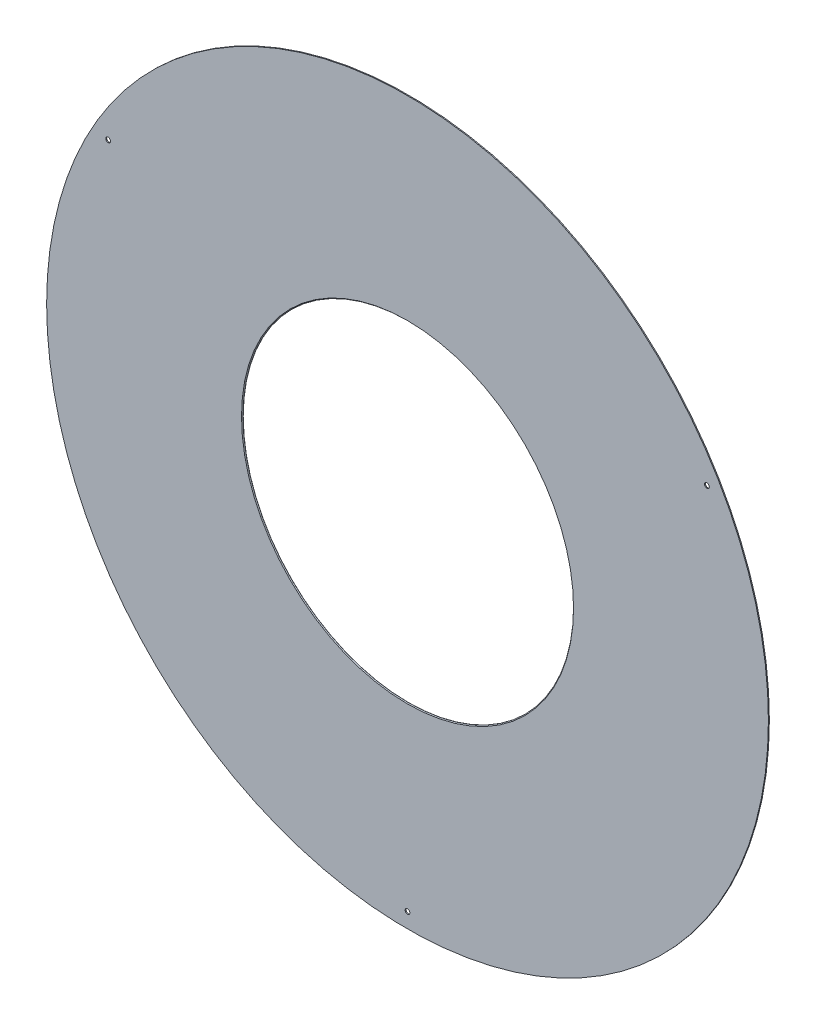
ISO-10303-21;
HEADER;
FILE_DESCRIPTION(('STEP AP214'),'2;1');
FILE_NAME('part.step','',(''),(''),'','','');
FILE_SCHEMA(('AUTOMOTIVE_DESIGN { 1 0 10303 214 1 1 1 1 }'));
ENDSEC;
DATA;
#1=APPLICATION_CONTEXT('core data for automotive mechanical design processes');
#2=APPLICATION_PROTOCOL_DEFINITION('international standard','automotive_design',2000,#1);
#3=PRODUCT_CONTEXT('',#1,'mechanical');
#4=PRODUCT('Part','Part','',(#3));
#5=PRODUCT_RELATED_PRODUCT_CATEGORY('part','',(#4));
#6=PRODUCT_DEFINITION_FORMATION('','',#4);
#7=PRODUCT_DEFINITION_CONTEXT('part definition',#1,'design');
#8=PRODUCT_DEFINITION('design','',#6,#7);
#9=PRODUCT_DEFINITION_SHAPE('','',#8);
#10=(LENGTH_UNIT() NAMED_UNIT(*) SI_UNIT(.MILLI.,.METRE.));
#11=(NAMED_UNIT(*) PLANE_ANGLE_UNIT() SI_UNIT($,.RADIAN.));
#12=(NAMED_UNIT(*) SI_UNIT($,.STERADIAN.) SOLID_ANGLE_UNIT());
#13=UNCERTAINTY_MEASURE_WITH_UNIT(LENGTH_MEASURE(1.E-05),#10,'distance_accuracy_value','');
#14=(GEOMETRIC_REPRESENTATION_CONTEXT(3) GLOBAL_UNCERTAINTY_ASSIGNED_CONTEXT((#13)) GLOBAL_UNIT_ASSIGNED_CONTEXT((#10,
#11,#12)) REPRESENTATION_CONTEXT('',''));
#15=CARTESIAN_POINT('',(0.,0.,0.));
#16=DIRECTION('',(0.,0.,1.));
#17=DIRECTION('',(1.,0.,0.));
#18=AXIS2_PLACEMENT_3D('',#15,#16,#17);
#19=CARTESIAN_POINT('',(0.,0.,1.5875));
#20=DIRECTION('',(0.,0.,1.));
#21=DIRECTION('',(1.,0.,0.));
#22=AXIS2_PLACEMENT_3D('',#19,#20,#21);
#23=PLANE('',#22);
#24=CARTESIAN_POINT('',(-500.432779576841,288.924999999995,1.5875));
#25=DIRECTION('',(0.,0.,1.));
#26=DIRECTION('',(1.,0.,0.));
#27=AXIS2_PLACEMENT_3D('',#24,#25,#26);
#28=CIRCLE('',#27,3.96874999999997);
#29=CARTESIAN_POINT('',(-496.464029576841,288.924999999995,1.5875));
#30=VERTEX_POINT('',#29);
#31=EDGE_CURVE('E69',#30,#30,#28,.T.);
#32=ORIENTED_EDGE('',*,*,#31,.F.);
#33=EDGE_LOOP('',(#32));
#34=FACE_BOUND('',#33,.T.);
#35=CARTESIAN_POINT('',(500.432779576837,288.925000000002,1.5875));
#36=DIRECTION('',(0.,0.,1.));
#37=DIRECTION('',(1.,0.,0.));
#38=AXIS2_PLACEMENT_3D('',#35,#36,#37);
#39=CIRCLE('',#38,3.96874999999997);
#40=CARTESIAN_POINT('',(504.401529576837,288.925000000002,1.5875));
#41=VERTEX_POINT('',#40);
#42=EDGE_CURVE('E63',#41,#41,#39,.T.);
#43=ORIENTED_EDGE('',*,*,#42,.F.);
#44=EDGE_LOOP('',(#43));
#45=FACE_BOUND('',#44,.T.);
#46=CARTESIAN_POINT('',(0.,-577.85,1.5875));
#47=DIRECTION('',(0.,0.,1.));
#48=DIRECTION('',(1.,0.,0.));
#49=AXIS2_PLACEMENT_3D('',#46,#47,#48);
#50=CIRCLE('',#49,3.96874999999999);
#51=CARTESIAN_POINT('',(3.96874999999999,-577.85,1.5875));
#52=VERTEX_POINT('',#51);
#53=EDGE_CURVE('E57',#52,#52,#50,.T.);
#54=ORIENTED_EDGE('',*,*,#53,.F.);
#55=EDGE_LOOP('',(#54));
#56=FACE_BOUND('',#55,.T.);
#57=CARTESIAN_POINT('',(0.,0.,1.5875));
#58=DIRECTION('',(0.,0.,1.));
#59=DIRECTION('',(1.,0.,0.));
#60=AXIS2_PLACEMENT_3D('',#57,#58,#59);
#61=CIRCLE('',#60,277.495);
#62=CARTESIAN_POINT('',(277.495,0.,1.5875));
#63=VERTEX_POINT('',#62);
#64=EDGE_CURVE('E10',#63,#63,#61,.F.);
#65=ORIENTED_EDGE('',*,*,#64,.T.);
#66=EDGE_LOOP('',(#65));
#67=FACE_BOUND('',#66,.T.);
#68=CARTESIAN_POINT('',(0.,0.,1.5875));
#69=DIRECTION('',(0.,0.,1.));
#70=DIRECTION('',(1.,0.,0.));
#71=AXIS2_PLACEMENT_3D('',#68,#69,#70);
#72=CIRCLE('',#71,603.25);
#73=CARTESIAN_POINT('',(603.25,0.,1.5875));
#74=VERTEX_POINT('',#73);
#75=EDGE_CURVE('E42',#74,#74,#72,.T.);
#76=ORIENTED_EDGE('',*,*,#75,.T.);
#77=EDGE_LOOP('',(#76));
#78=FACE_BOUND('',#77,.T.);
#79=ADVANCED_FACE('F31',(#34,#45,#56,#67,#78),#23,.T.);
#80=CARTESIAN_POINT('',(0.,0.,0.));
#81=DIRECTION('',(0.,0.,1.));
#82=DIRECTION('',(1.,0.,0.));
#83=AXIS2_PLACEMENT_3D('',#80,#81,#82);
#84=PLANE('',#83);
#85=CARTESIAN_POINT('',(-500.432779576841,288.924999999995,0.));
#86=DIRECTION('',(0.,0.,1.));
#87=DIRECTION('',(1.,0.,0.));
#88=AXIS2_PLACEMENT_3D('',#85,#86,#87);
#89=CIRCLE('',#88,3.96874999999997);
#90=CARTESIAN_POINT('',(-496.464029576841,288.924999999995,0.));
#91=VERTEX_POINT('',#90);
#92=EDGE_CURVE('E66',#91,#91,#89,.T.);
#93=ORIENTED_EDGE('',*,*,#92,.T.);
#94=EDGE_LOOP('',(#93));
#95=FACE_BOUND('',#94,.T.);
#96=CARTESIAN_POINT('',(500.432779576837,288.925000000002,0.));
#97=DIRECTION('',(0.,0.,1.));
#98=DIRECTION('',(1.,0.,0.));
#99=AXIS2_PLACEMENT_3D('',#96,#97,#98);
#100=CIRCLE('',#99,3.96874999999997);
#101=CARTESIAN_POINT('',(504.401529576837,288.925000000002,0.));
#102=VERTEX_POINT('',#101);
#103=EDGE_CURVE('E60',#102,#102,#100,.T.);
#104=ORIENTED_EDGE('',*,*,#103,.T.);
#105=EDGE_LOOP('',(#104));
#106=FACE_BOUND('',#105,.T.);
#107=CARTESIAN_POINT('',(0.,-577.85,0.));
#108=DIRECTION('',(0.,0.,1.));
#109=DIRECTION('',(1.,0.,0.));
#110=AXIS2_PLACEMENT_3D('',#107,#108,#109);
#111=CIRCLE('',#110,3.96874999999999);
#112=CARTESIAN_POINT('',(3.96874999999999,-577.85,0.));
#113=VERTEX_POINT('',#112);
#114=EDGE_CURVE('E54',#113,#113,#111,.T.);
#115=ORIENTED_EDGE('',*,*,#114,.T.);
#116=EDGE_LOOP('',(#115));
#117=FACE_BOUND('',#116,.T.);
#118=CARTESIAN_POINT('',(0.,0.,0.));
#119=DIRECTION('',(0.,0.,1.));
#120=DIRECTION('',(1.,0.,0.));
#121=AXIS2_PLACEMENT_3D('',#118,#119,#120);
#122=CIRCLE('',#121,603.25);
#123=CARTESIAN_POINT('',(603.25,0.,0.));
#124=VERTEX_POINT('',#123);
#125=EDGE_CURVE('E46',#124,#124,#122,.T.);
#126=ORIENTED_EDGE('',*,*,#125,.F.);
#127=EDGE_LOOP('',(#126));
#128=FACE_BOUND('',#127,.T.);
#129=CARTESIAN_POINT('',(0.,0.,0.));
#130=DIRECTION('',(0.,0.,1.));
#131=DIRECTION('',(1.,0.,0.));
#132=AXIS2_PLACEMENT_3D('',#129,#130,#131);
#133=CIRCLE('',#132,276.225);
#134=CARTESIAN_POINT('',(276.225,0.,0.));
#135=VERTEX_POINT('',#134);
#136=EDGE_CURVE('E50',#135,#135,#133,.T.);
#137=ORIENTED_EDGE('',*,*,#136,.T.);
#138=EDGE_LOOP('',(#137));
#139=FACE_BOUND('',#138,.T.);
#140=ADVANCED_FACE('F77',(#95,#106,#117,#128,#139),#84,.F.);
#141=CARTESIAN_POINT('',(0.,0.,1.5875));
#142=DIRECTION('',(0.,0.,-1.));
#143=DIRECTION('',(-1.,0.,0.));
#144=AXIS2_PLACEMENT_3D('',#141,#142,#143);
#145=CYLINDRICAL_SURFACE('',#144,603.25);
#146=ORIENTED_EDGE('',*,*,#75,.F.);
#147=EDGE_LOOP('',(#146));
#148=FACE_BOUND('',#147,.T.);
#149=ORIENTED_EDGE('',*,*,#125,.T.);
#150=EDGE_LOOP('',(#149));
#151=FACE_BOUND('',#150,.T.);
#152=ADVANCED_FACE('F85',(#148,#151),#145,.T.);
#153=CARTESIAN_POINT('',(0.,0.,1.5875));
#154=DIRECTION('',(0.,0.,-1.));
#155=DIRECTION('',(-1.,0.,0.));
#156=AXIS2_PLACEMENT_3D('',#153,#154,#155);
#157=CYLINDRICAL_SURFACE('',#156,276.225);
#158=CARTESIAN_POINT('',(0.,0.,0.317499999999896));
#159=DIRECTION('',(0.,0.,1.));
#160=DIRECTION('',(1.,0.,0.));
#161=AXIS2_PLACEMENT_3D('',#158,#159,#160);
#162=CIRCLE('',#161,276.225);
#163=CARTESIAN_POINT('',(276.225,0.,0.317499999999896));
#164=VERTEX_POINT('',#163);
#165=EDGE_CURVE('E38',#164,#164,#162,.T.);
#166=ORIENTED_EDGE('',*,*,#165,.T.);
#167=EDGE_LOOP('',(#166));
#168=FACE_BOUND('',#167,.T.);
#169=ORIENTED_EDGE('',*,*,#136,.F.);
#170=EDGE_LOOP('',(#169));
#171=FACE_BOUND('',#170,.T.);
#172=ADVANCED_FACE('F88',(#168,#171),#157,.F.);
#173=CARTESIAN_POINT('',(0.,0.,0.317499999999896));
#174=DIRECTION('',(0.,0.,1.));
#175=DIRECTION('',(1.,0.,0.));
#176=AXIS2_PLACEMENT_3D('',#173,#174,#175);
#177=CONICAL_SURFACE('',#176,276.225,0.785398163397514);
#178=ORIENTED_EDGE('',*,*,#64,.F.);
#179=EDGE_LOOP('',(#178));
#180=FACE_BOUND('',#179,.T.);
#181=ORIENTED_EDGE('',*,*,#165,.F.);
#182=EDGE_LOOP('',(#181));
#183=FACE_BOUND('',#182,.T.);
#184=ADVANCED_FACE('F33',(#180,#183),#177,.F.);
#185=CARTESIAN_POINT('',(0.,-577.85,1.5875));
#186=DIRECTION('',(0.,0.,1.));
#187=DIRECTION('',(1.,0.,0.));
#188=AXIS2_PLACEMENT_3D('',#185,#186,#187);
#189=CYLINDRICAL_SURFACE('',#188,3.96874999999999);
#190=ORIENTED_EDGE('',*,*,#114,.F.);
#191=EDGE_LOOP('',(#190));
#192=FACE_BOUND('',#191,.T.);
#193=ORIENTED_EDGE('',*,*,#53,.T.);
#194=EDGE_LOOP('',(#193));
#195=FACE_BOUND('',#194,.T.);
#196=ADVANCED_FACE('F102',(#192,#195),#189,.F.);
#197=CARTESIAN_POINT('',(500.432779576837,288.925000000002,1.5875));
#198=DIRECTION('',(0.,0.,1.));
#199=DIRECTION('',(1.,0.,0.));
#200=AXIS2_PLACEMENT_3D('',#197,#198,#199);
#201=CYLINDRICAL_SURFACE('',#200,3.96874999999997);
#202=ORIENTED_EDGE('',*,*,#103,.F.);
#203=EDGE_LOOP('',(#202));
#204=FACE_BOUND('',#203,.T.);
#205=ORIENTED_EDGE('',*,*,#42,.T.);
#206=EDGE_LOOP('',(#205));
#207=FACE_BOUND('',#206,.T.);
#208=ADVANCED_FACE('F107',(#204,#207),#201,.F.);
#209=CARTESIAN_POINT('',(-500.432779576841,288.924999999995,1.5875));
#210=DIRECTION('',(0.,0.,1.));
#211=DIRECTION('',(1.,0.,0.));
#212=AXIS2_PLACEMENT_3D('',#209,#210,#211);
#213=CYLINDRICAL_SURFACE('',#212,3.96874999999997);
#214=ORIENTED_EDGE('',*,*,#92,.F.);
#215=EDGE_LOOP('',(#214));
#216=FACE_BOUND('',#215,.T.);
#217=ORIENTED_EDGE('',*,*,#31,.T.);
#218=EDGE_LOOP('',(#217));
#219=FACE_BOUND('',#218,.T.);
#220=ADVANCED_FACE('F73',(#216,#219),#213,.F.);
#221=CLOSED_SHELL('',(#79,#140,#152,#172,#184,#196,#208,#220));
#222=MANIFOLD_SOLID_BREP('B2',#221);
#223=ADVANCED_BREP_SHAPE_REPRESENTATION('',(#18,#222),#14);
#224=SHAPE_DEFINITION_REPRESENTATION(#9,#223);
ENDSEC;
END-ISO-10303-21;
